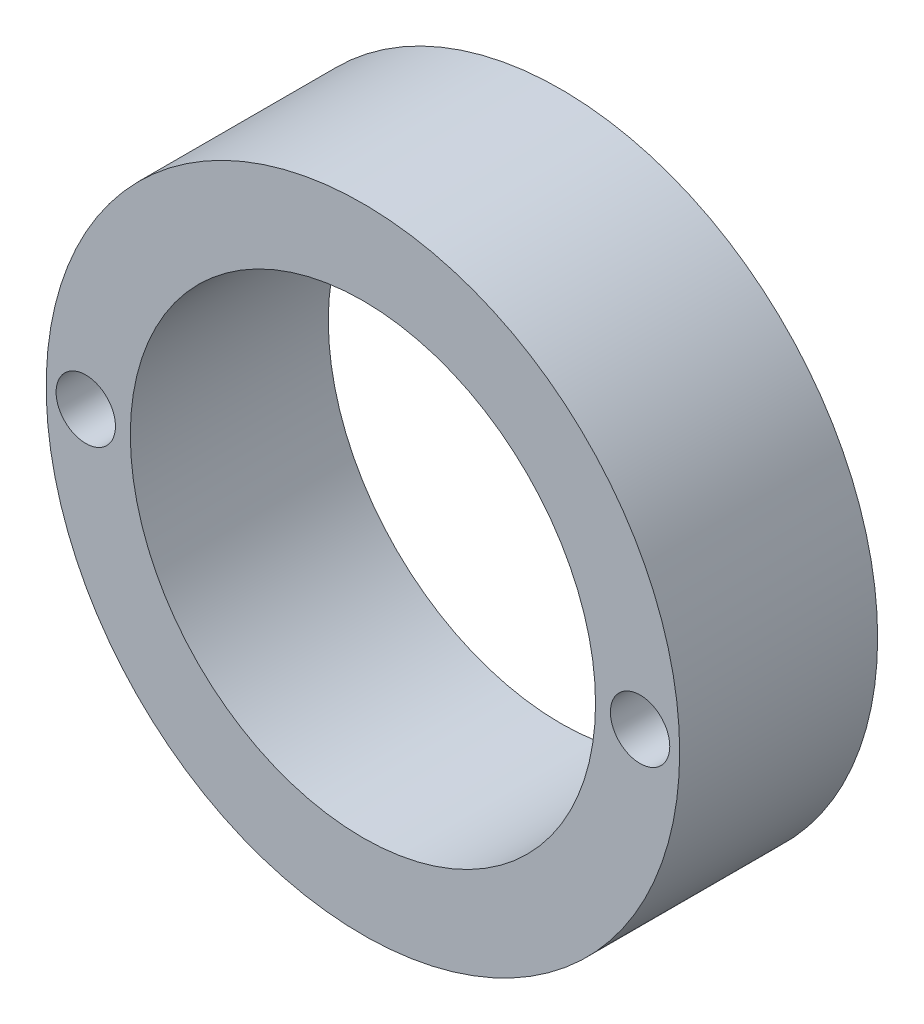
from build123d import *

# Parameters (mm, degrees)
ESQUISSE1_R          = 32
ESQUISSE1_R_2        = 23.5
ESQUISSE1_R_3        = 3
BASE_EXTRUSION_DEPTH = 20


with BuildPart() as part:
    # Esquisse1 → Base-Extrusion (new body)
    with BuildSketch(Plane.XY):
        Circle(ESQUISSE1_R)
        Circle(ESQUISSE1_R_2, mode=Mode.SUBTRACT)
        with Locations((-28, 0)):
            Circle(ESQUISSE1_R_3, mode=Mode.SUBTRACT)
        with Locations((28, 0)):
            Circle(ESQUISSE1_R_3, mode=Mode.SUBTRACT)
    extrude(amount=BASE_EXTRUSION_DEPTH)


solid = part.part
